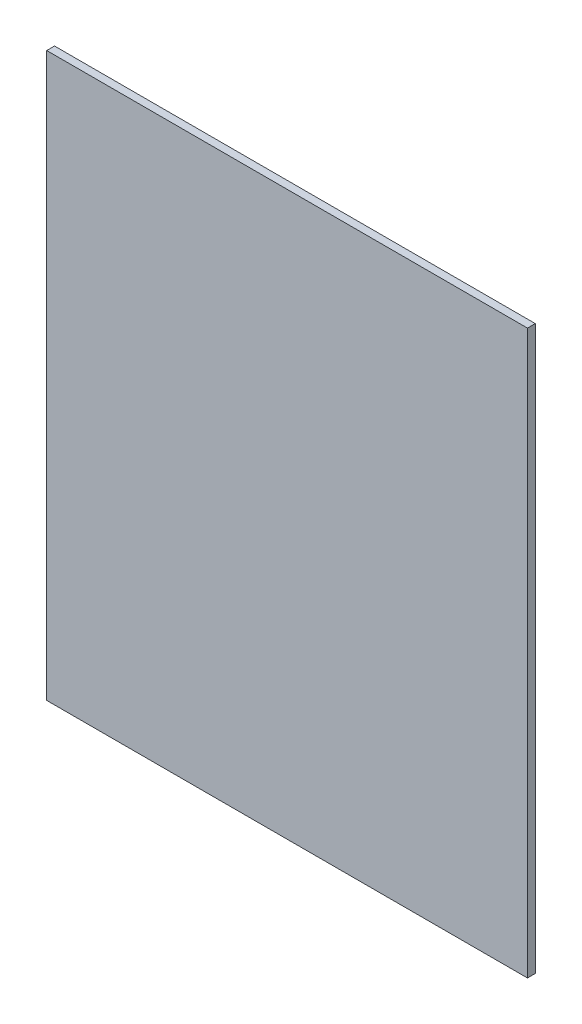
ISO-10303-21;
HEADER;
FILE_DESCRIPTION(('STEP AP214'),'2;1');
FILE_NAME('part.step','',(''),(''),'','','');
FILE_SCHEMA(('AUTOMOTIVE_DESIGN { 1 0 10303 214 1 1 1 1 }'));
ENDSEC;
DATA;
#1=APPLICATION_CONTEXT('core data for automotive mechanical design processes');
#2=APPLICATION_PROTOCOL_DEFINITION('international standard','automotive_design',2000,#1);
#3=PRODUCT_CONTEXT('',#1,'mechanical');
#4=PRODUCT('Part','Part','',(#3));
#5=PRODUCT_RELATED_PRODUCT_CATEGORY('part','',(#4));
#6=PRODUCT_DEFINITION_FORMATION('','',#4);
#7=PRODUCT_DEFINITION_CONTEXT('part definition',#1,'design');
#8=PRODUCT_DEFINITION('design','',#6,#7);
#9=PRODUCT_DEFINITION_SHAPE('','',#8);
#10=(LENGTH_UNIT() NAMED_UNIT(*) SI_UNIT(.MILLI.,.METRE.));
#11=(NAMED_UNIT(*) PLANE_ANGLE_UNIT() SI_UNIT($,.RADIAN.));
#12=(NAMED_UNIT(*) SI_UNIT($,.STERADIAN.) SOLID_ANGLE_UNIT());
#13=UNCERTAINTY_MEASURE_WITH_UNIT(LENGTH_MEASURE(1.E-05),#10,'distance_accuracy_value','');
#14=(GEOMETRIC_REPRESENTATION_CONTEXT(3) GLOBAL_UNCERTAINTY_ASSIGNED_CONTEXT((#13)) GLOBAL_UNIT_ASSIGNED_CONTEXT((#10,
#11,#12)) REPRESENTATION_CONTEXT('',''));
#15=CARTESIAN_POINT('',(0.,0.,0.));
#16=DIRECTION('',(0.,0.,1.));
#17=DIRECTION('',(1.,0.,0.));
#18=AXIS2_PLACEMENT_3D('',#15,#16,#17);
#19=CARTESIAN_POINT('',(0.,0.,10.0000000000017));
#20=DIRECTION('',(1.,0.,0.));
#21=DIRECTION('',(0.,0.,-1.));
#22=AXIS2_PLACEMENT_3D('',#19,#20,#21);
#23=PLANE('',#22);
#24=DIRECTION('',(0.,-1.,0.));
#25=VECTOR('',#24,1.);
#26=CARTESIAN_POINT('',(0.,0.,1.66533453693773E-12));
#27=LINE('',#26,#25);
#28=CARTESIAN_POINT('',(0.,720.,0.));
#29=VERTEX_POINT('',#28);
#30=CARTESIAN_POINT('',(0.,0.,1.66533453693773E-12));
#31=VERTEX_POINT('',#30);
#32=EDGE_CURVE('E81',#29,#31,#27,.T.);
#33=ORIENTED_EDGE('',*,*,#32,.T.);
#34=DIRECTION('',(0.,0.,-1.));
#35=VECTOR('',#34,1.);
#36=CARTESIAN_POINT('',(0.,0.,10.0000000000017));
#37=LINE('',#36,#35);
#38=CARTESIAN_POINT('',(0.,0.,10.0000000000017));
#39=VERTEX_POINT('',#38);
#40=EDGE_CURVE('E11',#39,#31,#37,.T.);
#41=ORIENTED_EDGE('',*,*,#40,.F.);
#42=DIRECTION('',(0.,-1.,0.));
#43=VECTOR('',#42,1.);
#44=CARTESIAN_POINT('',(0.,0.,10.0000000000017));
#45=LINE('',#44,#43);
#46=CARTESIAN_POINT('',(0.,720.,10.));
#47=VERTEX_POINT('',#46);
#48=EDGE_CURVE('E103',#47,#39,#45,.T.);
#49=ORIENTED_EDGE('',*,*,#48,.F.);
#50=DIRECTION('',(0.,0.,-1.));
#51=VECTOR('',#50,1.);
#52=CARTESIAN_POINT('',(0.,720.,10.));
#53=LINE('',#52,#51);
#54=EDGE_CURVE('E94',#47,#29,#53,.T.);
#55=ORIENTED_EDGE('',*,*,#54,.T.);
#56=EDGE_LOOP('',(#33,#41,#49,#55));
#57=FACE_BOUND('',#56,.T.);
#58=ADVANCED_FACE('F36',(#57),#23,.F.);
#59=CARTESIAN_POINT('',(0.,0.,10.0000000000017));
#60=DIRECTION('',(0.,1.,0.));
#61=DIRECTION('',(0.,0.,1.));
#62=AXIS2_PLACEMENT_3D('',#59,#60,#61);
#63=PLANE('',#62);
#64=DIRECTION('',(1.,0.,0.));
#65=VECTOR('',#64,1.);
#66=CARTESIAN_POINT('',(0.,0.,1.66533453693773E-12));
#67=LINE('',#66,#65);
#68=CARTESIAN_POINT('',(615.,0.,0.));
#69=VERTEX_POINT('',#68);
#70=EDGE_CURVE('E77',#31,#69,#67,.T.);
#71=ORIENTED_EDGE('',*,*,#70,.T.);
#72=DIRECTION('',(0.,0.,-1.));
#73=VECTOR('',#72,1.);
#74=CARTESIAN_POINT('',(615.,0.,10.));
#75=LINE('',#74,#73);
#76=CARTESIAN_POINT('',(615.,0.,10.));
#77=VERTEX_POINT('',#76);
#78=EDGE_CURVE('E44',#77,#69,#75,.T.);
#79=ORIENTED_EDGE('',*,*,#78,.F.);
#80=DIRECTION('',(1.,0.,0.));
#81=VECTOR('',#80,1.);
#82=CARTESIAN_POINT('',(0.,0.,10.0000000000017));
#83=LINE('',#82,#81);
#84=EDGE_CURVE('E90',#39,#77,#83,.T.);
#85=ORIENTED_EDGE('',*,*,#84,.F.);
#86=ORIENTED_EDGE('',*,*,#40,.T.);
#87=EDGE_LOOP('',(#71,#79,#85,#86));
#88=FACE_BOUND('',#87,.T.);
#89=ADVANCED_FACE('F89',(#88),#63,.F.);
#90=CARTESIAN_POINT('',(615.,0.,10.));
#91=DIRECTION('',(-1.,0.,0.));
#92=DIRECTION('',(0.,0.,1.));
#93=AXIS2_PLACEMENT_3D('',#90,#91,#92);
#94=PLANE('',#93);
#95=DIRECTION('',(0.,1.,0.));
#96=VECTOR('',#95,1.);
#97=CARTESIAN_POINT('',(615.,0.,0.));
#98=LINE('',#97,#96);
#99=CARTESIAN_POINT('',(615.000000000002,720.,0.));
#100=VERTEX_POINT('',#99);
#101=EDGE_CURVE('E82',#69,#100,#98,.T.);
#102=ORIENTED_EDGE('',*,*,#101,.T.);
#103=DIRECTION('',(0.,0.,-1.));
#104=VECTOR('',#103,1.);
#105=CARTESIAN_POINT('',(615.,720.,10.));
#106=LINE('',#105,#104);
#107=CARTESIAN_POINT('',(615.,720.,10.));
#108=VERTEX_POINT('',#107);
#109=EDGE_CURVE('E114',#108,#100,#106,.T.);
#110=ORIENTED_EDGE('',*,*,#109,.F.);
#111=DIRECTION('',(0.,1.,0.));
#112=VECTOR('',#111,1.);
#113=CARTESIAN_POINT('',(615.,0.,10.));
#114=LINE('',#113,#112);
#115=EDGE_CURVE('E56',#77,#108,#114,.T.);
#116=ORIENTED_EDGE('',*,*,#115,.F.);
#117=ORIENTED_EDGE('',*,*,#78,.T.);
#118=EDGE_LOOP('',(#102,#110,#116,#117));
#119=FACE_BOUND('',#118,.T.);
#120=ADVANCED_FACE('F119',(#119),#94,.F.);
#121=CARTESIAN_POINT('',(615.,720.,10.));
#122=DIRECTION('',(0.,-1.,0.));
#123=DIRECTION('',(1.,0.,0.));
#124=AXIS2_PLACEMENT_3D('',#121,#122,#123);
#125=PLANE('',#124);
#126=DIRECTION('',(-1.,0.,0.));
#127=VECTOR('',#126,1.);
#128=CARTESIAN_POINT('',(615.000000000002,720.,0.));
#129=LINE('',#128,#127);
#130=EDGE_CURVE('E101',#100,#29,#129,.T.);
#131=ORIENTED_EDGE('',*,*,#130,.T.);
#132=ORIENTED_EDGE('',*,*,#54,.F.);
#133=DIRECTION('',(-1.,0.,0.));
#134=VECTOR('',#133,1.);
#135=CARTESIAN_POINT('',(615.,720.,10.));
#136=LINE('',#135,#134);
#137=EDGE_CURVE('E51',#108,#47,#136,.T.);
#138=ORIENTED_EDGE('',*,*,#137,.F.);
#139=ORIENTED_EDGE('',*,*,#109,.T.);
#140=EDGE_LOOP('',(#131,#132,#138,#139));
#141=FACE_BOUND('',#140,.T.);
#142=ADVANCED_FACE('F121',(#141),#125,.F.);
#143=CARTESIAN_POINT('',(0.,0.,10.0000000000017));
#144=DIRECTION('',(0.,0.,-1.));
#145=DIRECTION('',(-1.,0.,0.));
#146=AXIS2_PLACEMENT_3D('',#143,#144,#145);
#147=PLANE('',#146);
#148=ORIENTED_EDGE('',*,*,#48,.T.);
#149=ORIENTED_EDGE('',*,*,#84,.T.);
#150=ORIENTED_EDGE('',*,*,#115,.T.);
#151=ORIENTED_EDGE('',*,*,#137,.T.);
#152=EDGE_LOOP('',(#148,#149,#150,#151));
#153=FACE_BOUND('',#152,.T.);
#154=ADVANCED_FACE('F122',(#153),#147,.F.);
#155=CARTESIAN_POINT('',(0.,0.,1.66533453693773E-12));
#156=DIRECTION('',(0.,0.,-1.));
#157=DIRECTION('',(-1.,0.,0.));
#158=AXIS2_PLACEMENT_3D('',#155,#156,#157);
#159=PLANE('',#158);
#160=ORIENTED_EDGE('',*,*,#32,.F.);
#161=ORIENTED_EDGE('',*,*,#130,.F.);
#162=ORIENTED_EDGE('',*,*,#101,.F.);
#163=ORIENTED_EDGE('',*,*,#70,.F.);
#164=EDGE_LOOP('',(#160,#161,#162,#163));
#165=FACE_BOUND('',#164,.T.);
#166=ADVANCED_FACE('F78',(#165),#159,.T.);
#167=CLOSED_SHELL('',(#58,#89,#120,#142,#154,#166));
#168=MANIFOLD_SOLID_BREP('B2',#167);
#169=ADVANCED_BREP_SHAPE_REPRESENTATION('',(#18,#168),#14);
#170=SHAPE_DEFINITION_REPRESENTATION(#9,#169);
ENDSEC;
END-ISO-10303-21;
